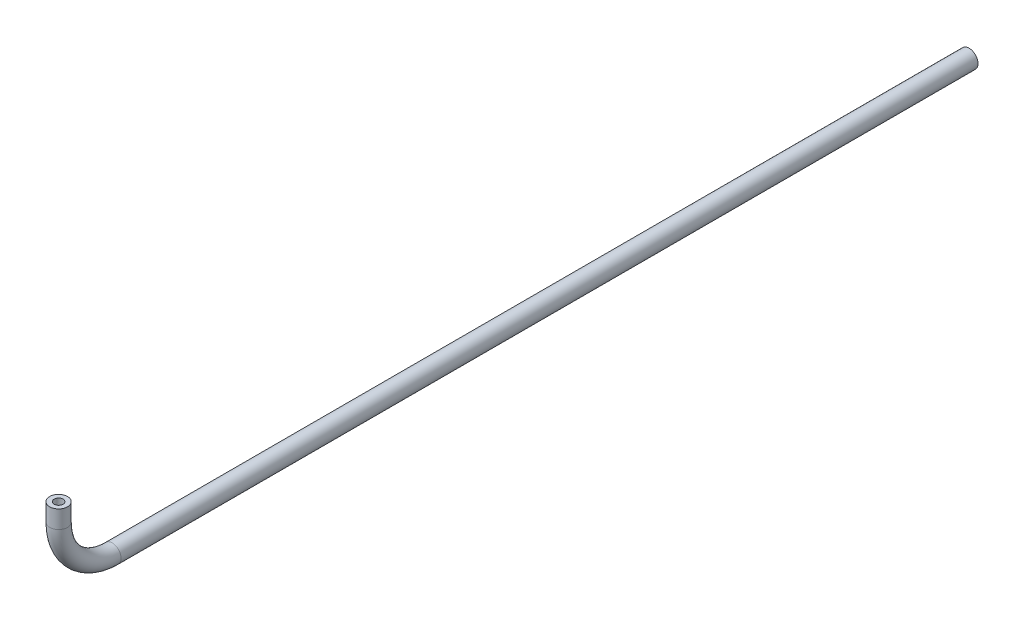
ISO-10303-21;
HEADER;
FILE_DESCRIPTION(('STEP AP214'),'2;1');
FILE_NAME('part.step','',(''),(''),'','','');
FILE_SCHEMA(('AUTOMOTIVE_DESIGN { 1 0 10303 214 1 1 1 1 }'));
ENDSEC;
DATA;
#1=APPLICATION_CONTEXT('core data for automotive mechanical design processes');
#2=APPLICATION_PROTOCOL_DEFINITION('international standard','automotive_design',2000,#1);
#3=PRODUCT_CONTEXT('',#1,'mechanical');
#4=PRODUCT('Part','Part','',(#3));
#5=PRODUCT_RELATED_PRODUCT_CATEGORY('part','',(#4));
#6=PRODUCT_DEFINITION_FORMATION('','',#4);
#7=PRODUCT_DEFINITION_CONTEXT('part definition',#1,'design');
#8=PRODUCT_DEFINITION('design','',#6,#7);
#9=PRODUCT_DEFINITION_SHAPE('','',#8);
#10=(LENGTH_UNIT() NAMED_UNIT(*) SI_UNIT(.MILLI.,.METRE.));
#11=(NAMED_UNIT(*) PLANE_ANGLE_UNIT() SI_UNIT($,.RADIAN.));
#12=(NAMED_UNIT(*) SI_UNIT($,.STERADIAN.) SOLID_ANGLE_UNIT());
#13=UNCERTAINTY_MEASURE_WITH_UNIT(LENGTH_MEASURE(1.E-05),#10,'distance_accuracy_value','');
#14=(GEOMETRIC_REPRESENTATION_CONTEXT(3) GLOBAL_UNCERTAINTY_ASSIGNED_CONTEXT((#13)) GLOBAL_UNIT_ASSIGNED_CONTEXT((#10,
#11,#12)) REPRESENTATION_CONTEXT('',''));
#15=CARTESIAN_POINT('',(0.,0.,0.));
#16=DIRECTION('',(0.,0.,1.));
#17=DIRECTION('',(1.,0.,0.));
#18=AXIS2_PLACEMENT_3D('',#15,#16,#17);
#19=CARTESIAN_POINT('',(0.,-6.35,-4.7625));
#20=DIRECTION('',(0.,0.,-1.));
#21=DIRECTION('',(0.,1.,0.));
#22=AXIS2_PLACEMENT_3D('',#19,#20,#21);
#23=CYLINDRICAL_SURFACE('',#22,0.79375);
#24=CARTESIAN_POINT('',(0.,-6.35,-4.7625));
#25=DIRECTION('',(0.,0.,1.));
#26=DIRECTION('',(0.,-1.,0.));
#27=AXIS2_PLACEMENT_3D('',#24,#25,#26);
#28=CIRCLE('',#27,0.79375);
#29=CARTESIAN_POINT('',(0.,-7.14375,-4.7625));
#30=VERTEX_POINT('',#29);
#31=EDGE_CURVE('E40',#30,#30,#28,.T.);
#32=ORIENTED_EDGE('',*,*,#31,.F.);
#33=EDGE_LOOP('',(#32));
#34=FACE_BOUND('',#33,.T.);
#35=CARTESIAN_POINT('',(0.,-6.35,-80.9625));
#36=DIRECTION('',(0.,0.,1.));
#37=DIRECTION('',(0.,-1.,0.));
#38=AXIS2_PLACEMENT_3D('',#35,#36,#37);
#39=CIRCLE('',#38,0.79375);
#40=CARTESIAN_POINT('',(0.,-7.14375,-80.9625));
#41=VERTEX_POINT('',#40);
#42=EDGE_CURVE('E10',#41,#41,#39,.T.);
#43=ORIENTED_EDGE('',*,*,#42,.T.);
#44=EDGE_LOOP('',(#43));
#45=FACE_BOUND('',#44,.T.);
#46=ADVANCED_FACE('F30',(#34,#45),#23,.T.);
#47=CARTESIAN_POINT('',(0.,-6.35,-4.7625));
#48=DIRECTION('',(0.,0.,-1.));
#49=DIRECTION('',(0.,1.,0.));
#50=AXIS2_PLACEMENT_3D('',#47,#48,#49);
#51=CYLINDRICAL_SURFACE('',#50,0.396875);
#52=CARTESIAN_POINT('',(0.,-6.35,-4.7625));
#53=DIRECTION('',(0.,0.,1.));
#54=DIRECTION('',(0.,-1.,0.));
#55=AXIS2_PLACEMENT_3D('',#52,#53,#54);
#56=CIRCLE('',#55,0.396875);
#57=CARTESIAN_POINT('',(0.,-6.746875,-4.7625));
#58=VERTEX_POINT('',#57);
#59=EDGE_CURVE('E44',#58,#58,#56,.T.);
#60=ORIENTED_EDGE('',*,*,#59,.T.);
#61=EDGE_LOOP('',(#60));
#62=FACE_BOUND('',#61,.T.);
#63=CARTESIAN_POINT('',(0.,-6.35,-80.9625));
#64=DIRECTION('',(0.,0.,1.));
#65=DIRECTION('',(0.,-1.,0.));
#66=AXIS2_PLACEMENT_3D('',#63,#64,#65);
#67=CIRCLE('',#66,0.396875);
#68=CARTESIAN_POINT('',(0.,-6.746875,-80.9625));
#69=VERTEX_POINT('',#68);
#70=EDGE_CURVE('E36',#69,#69,#67,.T.);
#71=ORIENTED_EDGE('',*,*,#70,.F.);
#72=EDGE_LOOP('',(#71));
#73=FACE_BOUND('',#72,.T.);
#74=ADVANCED_FACE('F87',(#62,#73),#51,.F.);
#75=CARTESIAN_POINT('',(0.,-1.5875,-4.7625));
#76=DIRECTION('',(1.,0.,0.));
#77=DIRECTION('',(0.,0.,-1.));
#78=AXIS2_PLACEMENT_3D('',#75,#76,#77);
#79=TOROIDAL_SURFACE('',#78,4.7625,0.79375);
#80=CARTESIAN_POINT('',(0.,-1.5875,0.));
#81=DIRECTION('',(0.,1.,0.));
#82=DIRECTION('',(0.,0.,1.));
#83=AXIS2_PLACEMENT_3D('',#80,#81,#82);
#84=CIRCLE('',#83,0.79375);
#85=CARTESIAN_POINT('',(0.,-1.5875,0.793749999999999));
#86=VERTEX_POINT('',#85);
#87=EDGE_CURVE('E49',#86,#86,#84,.T.);
#88=CARTESIAN_POINT('',(0.,-1.5875,-4.7625));
#89=DIRECTION('',(1.,0.,0.));
#90=DIRECTION('',(0.,0.,-1.));
#91=AXIS2_PLACEMENT_3D('',#88,#89,#90);
#92=CIRCLE('',#91,5.55625);
#93=EDGE_CURVE('',#86,#30,#92,.T.);
#94=ORIENTED_EDGE('',*,*,#87,.F.);
#95=ORIENTED_EDGE('',*,*,#31,.T.);
#96=ORIENTED_EDGE('',*,*,#93,.T.);
#97=ORIENTED_EDGE('',*,*,#93,.F.);
#98=EDGE_LOOP('',(#94,#96,#95,#97));
#99=FACE_BOUND('',#98,.T.);
#100=ADVANCED_FACE('F92',(#99),#79,.T.);
#101=CARTESIAN_POINT('',(0.,-1.5875,-4.7625));
#102=DIRECTION('',(1.,0.,0.));
#103=DIRECTION('',(0.,0.,-1.));
#104=AXIS2_PLACEMENT_3D('',#101,#102,#103);
#105=TOROIDAL_SURFACE('',#104,4.7625,0.396875);
#106=CARTESIAN_POINT('',(0.,-1.5875,0.));
#107=DIRECTION('',(0.,1.,0.));
#108=DIRECTION('',(0.,0.,1.));
#109=AXIS2_PLACEMENT_3D('',#106,#107,#108);
#110=CIRCLE('',#109,0.396875);
#111=CARTESIAN_POINT('',(0.,-1.5875,0.396874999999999));
#112=VERTEX_POINT('',#111);
#113=EDGE_CURVE('E53',#112,#112,#110,.T.);
#114=CARTESIAN_POINT('',(0.,-1.5875,-4.7625));
#115=DIRECTION('',(1.,0.,0.));
#116=DIRECTION('',(0.,0.,-1.));
#117=AXIS2_PLACEMENT_3D('',#114,#115,#116);
#118=CIRCLE('',#117,5.159375);
#119=EDGE_CURVE('',#112,#58,#118,.T.);
#120=ORIENTED_EDGE('',*,*,#113,.T.);
#121=ORIENTED_EDGE('',*,*,#59,.F.);
#122=ORIENTED_EDGE('',*,*,#119,.T.);
#123=ORIENTED_EDGE('',*,*,#119,.F.);
#124=EDGE_LOOP('',(#120,#122,#121,#123));
#125=FACE_BOUND('',#124,.T.);
#126=ADVANCED_FACE('F62',(#125),#105,.F.);
#127=CARTESIAN_POINT('',(0.,-1.5875,0.));
#128=DIRECTION('',(0.,1.,0.));
#129=DIRECTION('',(0.,0.,1.));
#130=AXIS2_PLACEMENT_3D('',#127,#128,#129);
#131=CYLINDRICAL_SURFACE('',#130,0.396875);
#132=ORIENTED_EDGE('',*,*,#113,.F.);
#133=EDGE_LOOP('',(#132));
#134=FACE_BOUND('',#133,.T.);
#135=CARTESIAN_POINT('',(0.,0.,0.));
#136=DIRECTION('',(0.,1.,0.));
#137=DIRECTION('',(0.,0.,1.));
#138=AXIS2_PLACEMENT_3D('',#135,#136,#137);
#139=CIRCLE('',#138,0.396875);
#140=CARTESIAN_POINT('',(0.,0.,0.396875));
#141=VERTEX_POINT('',#140);
#142=EDGE_CURVE('E54',#141,#141,#139,.T.);
#143=ORIENTED_EDGE('',*,*,#142,.T.);
#144=EDGE_LOOP('',(#143));
#145=FACE_BOUND('',#144,.T.);
#146=ADVANCED_FACE('F65',(#134,#145),#131,.F.);
#147=CARTESIAN_POINT('',(0.,-1.5875,0.));
#148=DIRECTION('',(0.,1.,0.));
#149=DIRECTION('',(0.,0.,1.));
#150=AXIS2_PLACEMENT_3D('',#147,#148,#149);
#151=CYLINDRICAL_SURFACE('',#150,0.79375);
#152=ORIENTED_EDGE('',*,*,#87,.T.);
#153=EDGE_LOOP('',(#152));
#154=FACE_BOUND('',#153,.T.);
#155=CARTESIAN_POINT('',(0.,0.,0.));
#156=DIRECTION('',(0.,1.,0.));
#157=DIRECTION('',(0.,0.,1.));
#158=AXIS2_PLACEMENT_3D('',#155,#156,#157);
#159=CIRCLE('',#158,0.79375);
#160=CARTESIAN_POINT('',(0.,0.,0.79375));
#161=VERTEX_POINT('',#160);
#162=EDGE_CURVE('E50',#161,#161,#159,.T.);
#163=ORIENTED_EDGE('',*,*,#162,.F.);
#164=EDGE_LOOP('',(#163));
#165=FACE_BOUND('',#164,.T.);
#166=ADVANCED_FACE('F68',(#154,#165),#151,.T.);
#167=CARTESIAN_POINT('',(0.,-6.35,-80.9625));
#168=DIRECTION('',(0.,0.,1.));
#169=DIRECTION('',(0.,-1.,0.));
#170=AXIS2_PLACEMENT_3D('',#167,#168,#169);
#171=PLANE('',#170);
#172=ORIENTED_EDGE('',*,*,#70,.T.);
#173=EDGE_LOOP('',(#172));
#174=FACE_BOUND('',#173,.T.);
#175=ORIENTED_EDGE('',*,*,#42,.F.);
#176=EDGE_LOOP('',(#175));
#177=FACE_BOUND('',#176,.T.);
#178=ADVANCED_FACE('F75',(#174,#177),#171,.F.);
#179=CARTESIAN_POINT('',(0.,0.,0.));
#180=DIRECTION('',(0.,1.,0.));
#181=DIRECTION('',(0.,0.,1.));
#182=AXIS2_PLACEMENT_3D('',#179,#180,#181);
#183=PLANE('',#182);
#184=ORIENTED_EDGE('',*,*,#142,.F.);
#185=EDGE_LOOP('',(#184));
#186=FACE_BOUND('',#185,.T.);
#187=ORIENTED_EDGE('',*,*,#162,.T.);
#188=EDGE_LOOP('',(#187));
#189=FACE_BOUND('',#188,.T.);
#190=ADVANCED_FACE('F72',(#186,#189),#183,.T.);
#191=CLOSED_SHELL('',(#46,#74,#100,#126,#146,#166,#178,#190));
#192=MANIFOLD_SOLID_BREP('B2',#191);
#193=ADVANCED_BREP_SHAPE_REPRESENTATION('',(#18,#192),#14);
#194=SHAPE_DEFINITION_REPRESENTATION(#9,#193);
ENDSEC;
END-ISO-10303-21;
